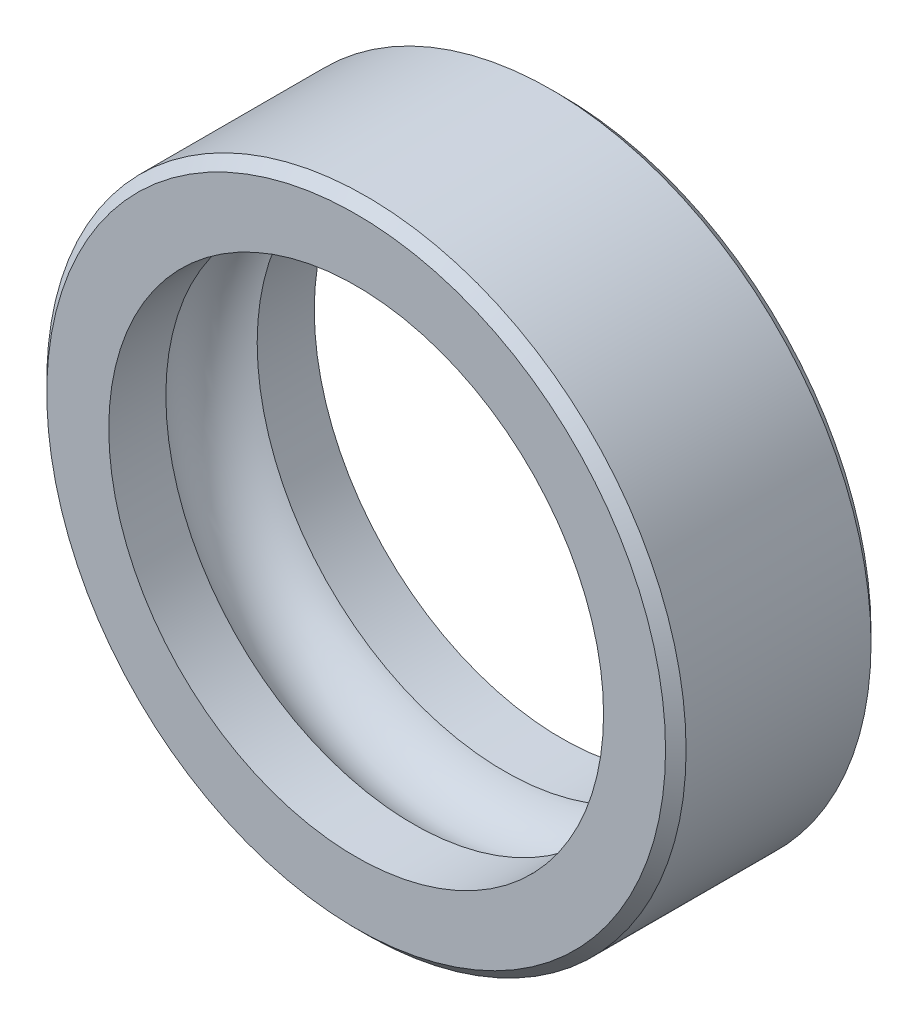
ISO-10303-21;
HEADER;
FILE_DESCRIPTION(('STEP AP214'),'2;1');
FILE_NAME('part.step','',(''),(''),'','','');
FILE_SCHEMA(('AUTOMOTIVE_DESIGN { 1 0 10303 214 1 1 1 1 }'));
ENDSEC;
DATA;
#1=APPLICATION_CONTEXT('core data for automotive mechanical design processes');
#2=APPLICATION_PROTOCOL_DEFINITION('international standard','automotive_design',2000,#1);
#3=PRODUCT_CONTEXT('',#1,'mechanical');
#4=PRODUCT('Part','Part','',(#3));
#5=PRODUCT_RELATED_PRODUCT_CATEGORY('part','',(#4));
#6=PRODUCT_DEFINITION_FORMATION('','',#4);
#7=PRODUCT_DEFINITION_CONTEXT('part definition',#1,'design');
#8=PRODUCT_DEFINITION('design','',#6,#7);
#9=PRODUCT_DEFINITION_SHAPE('','',#8);
#10=(LENGTH_UNIT() NAMED_UNIT(*) SI_UNIT(.MILLI.,.METRE.));
#11=(NAMED_UNIT(*) PLANE_ANGLE_UNIT() SI_UNIT($,.RADIAN.));
#12=(NAMED_UNIT(*) SI_UNIT($,.STERADIAN.) SOLID_ANGLE_UNIT());
#13=UNCERTAINTY_MEASURE_WITH_UNIT(LENGTH_MEASURE(1.E-05),#10,'distance_accuracy_value','');
#14=(GEOMETRIC_REPRESENTATION_CONTEXT(3) GLOBAL_UNCERTAINTY_ASSIGNED_CONTEXT((#13)) GLOBAL_UNIT_ASSIGNED_CONTEXT((#10,
#11,#12)) REPRESENTATION_CONTEXT('',''));
#15=CARTESIAN_POINT('',(0.,0.,0.));
#16=DIRECTION('',(0.,0.,1.));
#17=DIRECTION('',(1.,0.,0.));
#18=AXIS2_PLACEMENT_3D('',#15,#16,#17);
#19=CARTESIAN_POINT('',(0.,0.,3.571875));
#20=DIRECTION('',(0.,0.,1.));
#21=DIRECTION('',(1.,0.,0.));
#22=AXIS2_PLACEMENT_3D('',#19,#20,#21);
#23=CYLINDRICAL_SURFACE('',#22,8.60041208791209);
#24=CARTESIAN_POINT('',(0.,0.,1.5875));
#25=DIRECTION('',(0.,0.,1.));
#26=DIRECTION('',(1.,0.,0.));
#27=AXIS2_PLACEMENT_3D('',#24,#25,#26);
#28=CIRCLE('',#27,8.60041208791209);
#29=CARTESIAN_POINT('',(8.60041208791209,0.,1.5875));
#30=VERTEX_POINT('',#29);
#31=EDGE_CURVE('E11',#30,#30,#28,.T.);
#32=ORIENTED_EDGE('',*,*,#31,.F.);
#33=EDGE_LOOP('',(#32));
#34=FACE_BOUND('',#33,.T.);
#35=CARTESIAN_POINT('',(0.,0.,3.571875));
#36=DIRECTION('',(0.,0.,1.));
#37=DIRECTION('',(1.,0.,0.));
#38=AXIS2_PLACEMENT_3D('',#35,#36,#37);
#39=CIRCLE('',#38,8.60041208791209);
#40=CARTESIAN_POINT('',(8.60041208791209,0.,3.571875));
#41=VERTEX_POINT('',#40);
#42=EDGE_CURVE('E73',#41,#41,#39,.T.);
#43=ORIENTED_EDGE('',*,*,#42,.T.);
#44=EDGE_LOOP('',(#43));
#45=FACE_BOUND('',#44,.T.);
#46=ADVANCED_FACE('F17',(#34,#45),#23,.F.);
#47=CARTESIAN_POINT('',(0.,0.,0.));
#48=DIRECTION('',(0.,0.,1.));
#49=DIRECTION('',(1.,0.,0.));
#50=AXIS2_PLACEMENT_3D('',#47,#48,#49);
#51=TOROIDAL_SURFACE('',#50,7.9375,1.72035132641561);
#52=CARTESIAN_POINT('',(0.,0.,-1.5875));
#53=DIRECTION('',(0.,0.,1.));
#54=DIRECTION('',(1.,0.,0.));
#55=AXIS2_PLACEMENT_3D('',#52,#53,#54);
#56=CIRCLE('',#55,8.60041208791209);
#57=CARTESIAN_POINT('',(8.60041208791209,0.,-1.5875));
#58=VERTEX_POINT('',#57);
#59=EDGE_CURVE('E20',#58,#58,#56,.T.);
#60=ORIENTED_EDGE('',*,*,#59,.F.);
#61=EDGE_LOOP('',(#60));
#62=FACE_BOUND('',#61,.T.);
#63=ORIENTED_EDGE('',*,*,#31,.T.);
#64=EDGE_LOOP('',(#63));
#65=FACE_BOUND('',#64,.T.);
#66=ADVANCED_FACE('F103',(#62,#65),#51,.F.);
#67=CARTESIAN_POINT('',(0.,0.,3.571875));
#68=DIRECTION('',(0.,0.,1.));
#69=DIRECTION('',(1.,0.,0.));
#70=AXIS2_PLACEMENT_3D('',#67,#68,#69);
#71=CYLINDRICAL_SURFACE('',#70,8.60041208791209);
#72=CARTESIAN_POINT('',(0.,0.,-3.571875));
#73=DIRECTION('',(0.,0.,1.));
#74=DIRECTION('',(1.,0.,0.));
#75=AXIS2_PLACEMENT_3D('',#72,#73,#74);
#76=CIRCLE('',#75,8.60041208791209);
#77=CARTESIAN_POINT('',(8.60041208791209,0.,-3.571875));
#78=VERTEX_POINT('',#77);
#79=EDGE_CURVE('E66',#78,#78,#76,.T.);
#80=ORIENTED_EDGE('',*,*,#79,.F.);
#81=EDGE_LOOP('',(#80));
#82=FACE_BOUND('',#81,.T.);
#83=ORIENTED_EDGE('',*,*,#59,.T.);
#84=EDGE_LOOP('',(#83));
#85=FACE_BOUND('',#84,.T.);
#86=ADVANCED_FACE('F101',(#82,#85),#71,.F.);
#87=CARTESIAN_POINT('',(0.,0.,-3.571875));
#88=DIRECTION('',(0.,0.,1.));
#89=DIRECTION('',(1.,0.,0.));
#90=AXIS2_PLACEMENT_3D('',#87,#88,#89);
#91=CONICAL_SURFACE('',#90,10.7553125,0.785398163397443);
#92=CARTESIAN_POINT('',(0.,0.,-3.571875));
#93=DIRECTION('',(0.,0.,1.));
#94=DIRECTION('',(1.,0.,0.));
#95=AXIS2_PLACEMENT_3D('',#92,#93,#94);
#96=CIRCLE('',#95,10.7553125);
#97=CARTESIAN_POINT('',(10.7553125,0.,-3.571875));
#98=VERTEX_POINT('',#97);
#99=EDGE_CURVE('E90',#98,#98,#96,.T.);
#100=ORIENTED_EDGE('',*,*,#99,.T.);
#101=EDGE_LOOP('',(#100));
#102=FACE_BOUND('',#101,.T.);
#103=CARTESIAN_POINT('',(0.,0.,-3.21468750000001));
#104=DIRECTION('',(0.,0.,1.));
#105=DIRECTION('',(1.,0.,0.));
#106=AXIS2_PLACEMENT_3D('',#103,#104,#105);
#107=CIRCLE('',#106,11.1125);
#108=CARTESIAN_POINT('',(11.1125,0.,-3.21468750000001));
#109=VERTEX_POINT('',#108);
#110=EDGE_CURVE('E47',#109,#109,#107,.T.);
#111=ORIENTED_EDGE('',*,*,#110,.F.);
#112=EDGE_LOOP('',(#111));
#113=FACE_BOUND('',#112,.T.);
#114=ADVANCED_FACE('F112',(#102,#113),#91,.T.);
#115=CARTESIAN_POINT('',(0.,0.,3.571875));
#116=DIRECTION('',(0.,0.,1.));
#117=DIRECTION('',(1.,0.,0.));
#118=AXIS2_PLACEMENT_3D('',#115,#116,#117);
#119=CYLINDRICAL_SURFACE('',#118,11.1125);
#120=ORIENTED_EDGE('',*,*,#110,.T.);
#121=EDGE_LOOP('',(#120));
#122=FACE_BOUND('',#121,.T.);
#123=CARTESIAN_POINT('',(0.,0.,3.2146875));
#124=DIRECTION('',(0.,0.,1.));
#125=DIRECTION('',(1.,0.,0.));
#126=AXIS2_PLACEMENT_3D('',#123,#124,#125);
#127=CIRCLE('',#126,11.1125);
#128=CARTESIAN_POINT('',(11.1125,0.,3.2146875));
#129=VERTEX_POINT('',#128);
#130=EDGE_CURVE('E56',#129,#129,#127,.T.);
#131=ORIENTED_EDGE('',*,*,#130,.F.);
#132=EDGE_LOOP('',(#131));
#133=FACE_BOUND('',#132,.T.);
#134=ADVANCED_FACE('F118',(#122,#133),#119,.T.);
#135=CARTESIAN_POINT('',(0.,0.,3.2146875));
#136=DIRECTION('',(0.,0.,-1.));
#137=DIRECTION('',(-1.,0.,0.));
#138=AXIS2_PLACEMENT_3D('',#135,#136,#137);
#139=CONICAL_SURFACE('',#138,11.1125,0.785398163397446);
#140=CARTESIAN_POINT('',(0.,0.,3.571875));
#141=DIRECTION('',(0.,0.,1.));
#142=DIRECTION('',(1.,0.,0.));
#143=AXIS2_PLACEMENT_3D('',#140,#141,#142);
#144=CIRCLE('',#143,10.7553125);
#145=CARTESIAN_POINT('',(10.7553125,0.,3.571875));
#146=VERTEX_POINT('',#145);
#147=EDGE_CURVE('E79',#146,#146,#144,.T.);
#148=ORIENTED_EDGE('',*,*,#147,.F.);
#149=EDGE_LOOP('',(#148));
#150=FACE_BOUND('',#149,.T.);
#151=ORIENTED_EDGE('',*,*,#130,.T.);
#152=EDGE_LOOP('',(#151));
#153=FACE_BOUND('',#152,.T.);
#154=ADVANCED_FACE('F120',(#150,#153),#139,.T.);
#155=CARTESIAN_POINT('',(0.,10.7553125,-3.571875));
#156=DIRECTION('',(0.,0.,1.));
#157=DIRECTION('',(1.,0.,0.));
#158=AXIS2_PLACEMENT_3D('',#155,#156,#157);
#159=PLANE('',#158);
#160=ORIENTED_EDGE('',*,*,#99,.F.);
#161=EDGE_LOOP('',(#160));
#162=FACE_BOUND('',#161,.T.);
#163=ORIENTED_EDGE('',*,*,#79,.T.);
#164=EDGE_LOOP('',(#163));
#165=FACE_BOUND('',#164,.T.);
#166=ADVANCED_FACE('F123',(#162,#165),#159,.F.);
#167=CARTESIAN_POINT('',(0.,10.7553125,3.571875));
#168=DIRECTION('',(0.,0.,-1.));
#169=DIRECTION('',(0.,-1.,0.));
#170=AXIS2_PLACEMENT_3D('',#167,#168,#169);
#171=PLANE('',#170);
#172=ORIENTED_EDGE('',*,*,#42,.F.);
#173=EDGE_LOOP('',(#172));
#174=FACE_BOUND('',#173,.T.);
#175=ORIENTED_EDGE('',*,*,#147,.T.);
#176=EDGE_LOOP('',(#175));
#177=FACE_BOUND('',#176,.T.);
#178=ADVANCED_FACE('F80',(#174,#177),#171,.F.);
#179=CLOSED_SHELL('',(#46,#66,#86,#114,#134,#154,#166,#178));
#180=MANIFOLD_SOLID_BREP('B1',#179);
#181=ADVANCED_BREP_SHAPE_REPRESENTATION('',(#18,#180),#14);
#182=SHAPE_DEFINITION_REPRESENTATION(#9,#181);
ENDSEC;
END-ISO-10303-21;
